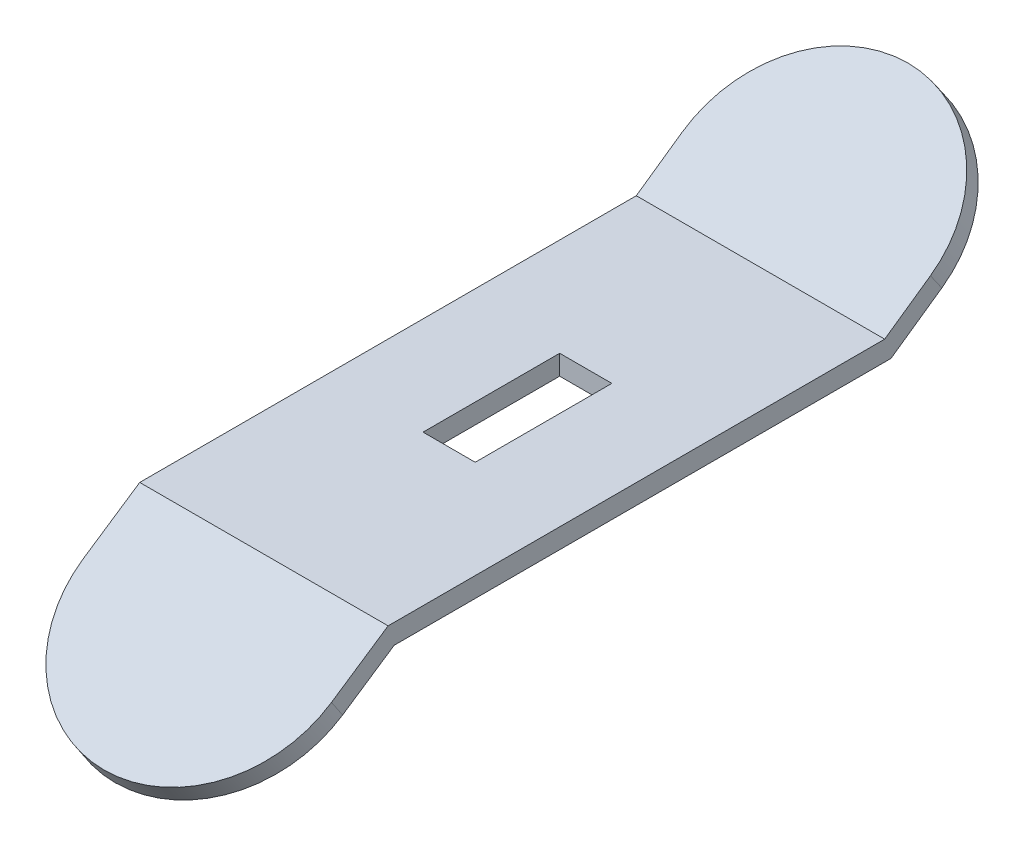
from build123d import *

# Parameters (mm, degrees)
EXTRU_MINCE1_DEPTH      = 10
CONG_1_RADIUS           = 10
CONG_1_LENGTH           = 1.6
CONG_2_RADIUS           = 10
CONG_2_LENGTH           = 1.6
ESQUISSE2_W             = 4.2
ESQUISSE2_H             = 11
ENL_V_MAT_EXTRU_1_DEPTH = 37.143712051


with BuildPart() as part:
    # Esquisse1 → Extru.-Mince1 (new, symmetric)
    with BuildSketch(Plane(origin=(0, 0, 0), x_dir=(0, 0, -1), z_dir=(1, 0, 0))):
        Polygon((-32.384190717, -8.355528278), (-19.926857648, 0), (0, 0), (20.073142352, 0), (32.360423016, 8.603646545), (31.442700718, 9.914289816), (19.56866429, 1.6), (0, 1.6), (-20.413752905, 1.6), (-33.275447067, -7.026746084), align=None)
    extrude(amount=EXTRU_MINCE1_DEPTH, both=True)

    # Cong_1: full round fillet: the end face becomes a half cylinder, R = half its width
    cong_1_face = Plane((0, -7.691137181, 32.829818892), x_dir=(0, -0.830488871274, -0.557035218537), z_dir=(0, -0.557035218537, 0.830488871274))  # on the end face: x along it, z out of the body
    cong_1_slab = cong_1_face.offset(-CONG_1_RADIUS / 2) * Box(CONG_1_LENGTH, 2 * CONG_1_RADIUS, CONG_1_RADIUS, mode=Mode.PRIVATE)  # the body's end, R deep
    cong_1_round = Plane((0, -2.120784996, 24.524930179), x_dir=(0, -0.557035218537, 0.830488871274), z_dir=(0, -0.830488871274, -0.557035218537)) * Cylinder(CONG_1_RADIUS, CONG_1_LENGTH, mode=Mode.PRIVATE)  # its axis R under the face
    add(cong_1_slab - cong_1_round, mode=Mode.SUBTRACT)

    # Cong_2: full round fillet: the end face becomes a half cylinder, R = half its width
    cong_2_face = Plane((0, 9.258968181, -31.901561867), x_dir=(0, -0.819152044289, -0.573576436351), z_dir=(0, 0.573576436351, -0.819152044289))  # on the end face: x along it, z out of the body
    cong_2_slab = cong_2_face.offset(-CONG_2_RADIUS / 2) * Box(CONG_2_LENGTH, 2 * CONG_2_RADIUS, CONG_2_RADIUS, mode=Mode.PRIVATE)  # the body's end, R deep
    cong_2_round = Plane((0, 3.523203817, -23.710041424), x_dir=(0, 0.573576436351, -0.819152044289), z_dir=(0, -0.819152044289, -0.573576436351)) * Cylinder(CONG_2_RADIUS, CONG_2_LENGTH, mode=Mode.PRIVATE)  # its axis R under the face
    add(cong_2_slab - cong_2_round, mode=Mode.SUBTRACT)

    # Esquisse2 → Enl_v. mat.-Extru.1 (cut, through all)
    with BuildSketch(Plane(origin=(0, 1.6, 0), x_dir=(1, 0, 0), z_dir=(0, 1, 0))):
        Rectangle(ESQUISSE2_W, ESQUISSE2_H)
    extrude(amount=-ENL_V_MAT_EXTRU_1_DEPTH, mode=Mode.SUBTRACT)


solid = part.part
